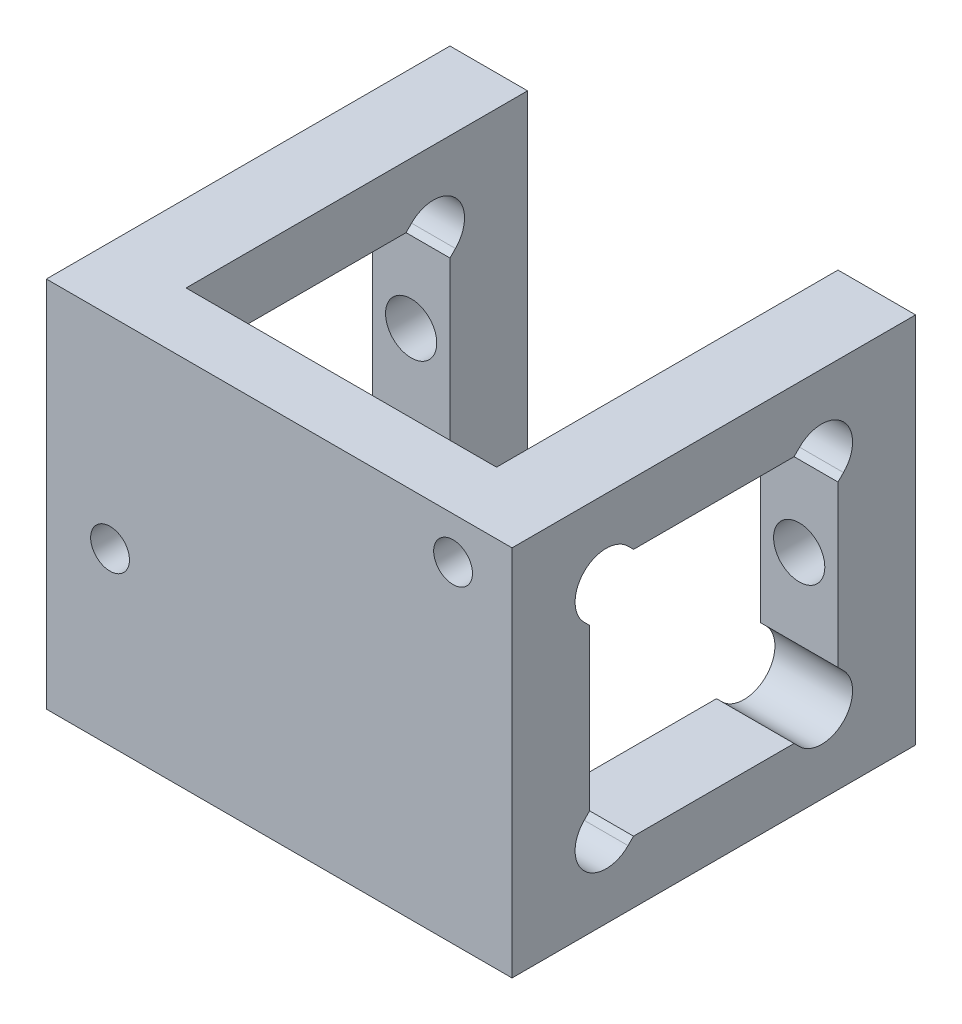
from build123d import *

# Parameters (mm, degrees)
BOSS_EXTRU_1_START      = 9
ESQUISSE1_W             = 30
ESQUISSE1_H             = 24
BOSS_EXTRU_1_DEPTH      = 4
ESQUISSE4_W             = 26
ESQUISSE4_H             = 24
ESQUISSE4_W_2           = 16
ESQUISSE4_H_2           = 16
BOSS_EXTRU_3_DEPTH      = 5
ENL_V_MAT_EXTRU_3_DEPTH = 10
BOSS_EXTRU_4_START      = -5
ESQUISSE11_W            = 22
ESQUISSE11_H            = 24
BOSS_EXTRU_4_DEPTH      = 5
TROU_TARAUD_M42_D       = 3.3
TROU_TARAUD_M42_DEPTH   = 11.5
TROU_TARAUD_M42_TIP     = 0.991420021
TROU_TARAUD_M31_D       = 2.5
TROU_TARAUD_M31_DEPTH   = 8.5
TROU_TARAUD_M31_TIP     = 0.751075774


with BuildPart() as part:
    # Esquisse1 → Boss.-Extru.1 (new body)
    with BuildSketch(Plane.XY.offset(BOSS_EXTRU_1_START)):
        with Locations((15, -12)):
            Rectangle(ESQUISSE1_W, ESQUISSE1_H)
    extrude(amount=BOSS_EXTRU_1_DEPTH)

    # Esquisse4 → Boss.-Extru.3 (add)
    with BuildSketch(Plane.ZY):
        with Locations((0, -12)):
            Rectangle(ESQUISSE4_W, ESQUISSE4_H)
        with Locations((0, -12)):
            Rectangle(ESQUISSE4_W_2, ESQUISSE4_H_2, mode=Mode.SUBTRACT)
    extrude(amount=-BOSS_EXTRU_3_DEPTH)

    # Esquisse10 → Enl_v. mat.-Extru.3 (cut)
    with BuildSketch(Plane.ZY):
        with BuildLine():
            Line((-5.525126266, -3.646446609), (-3.423589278, -5.747983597))
            Line((-3.423589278, -5.747983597), (-6.574535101, -8.253892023))
            Line((-6.574535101, -8.253892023), (-8.353553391, -6.474873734))
            ThreePointArc((-8.353553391, -6.474873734), (-8.353553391, -3.646446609), (-5.525126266, -3.646446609))
        make_face()
        with BuildLine():
            Line((8.352553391, -6.473873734), (6.251016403, -8.575410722))
            Line((6.251016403, -8.575410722), (3.745107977, -5.424464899))
            Line((3.745107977, -5.424464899), (5.524126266, -3.645446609))
            ThreePointArc((5.524126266, -3.645446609), (8.352553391, -3.645446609), (8.352553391, -6.473873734))
        make_face()
        with BuildLine():
            Line((5.525126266, -20.351553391), (3.423589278, -18.250016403))
            Line((3.423589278, -18.250016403), (6.574535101, -15.744107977))
            Line((6.574535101, -15.744107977), (8.353553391, -17.523126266))
            ThreePointArc((8.353553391, -17.523126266), (8.353553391, -20.351553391), (5.525126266, -20.351553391))
        make_face()
        with BuildLine():
            Line((-8.352553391, -17.524126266), (-6.251016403, -15.422589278))
            Line((-6.251016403, -15.422589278), (-3.745107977, -18.573535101))
            Line((-3.745107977, -18.573535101), (-5.524126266, -20.352553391))
            ThreePointArc((-5.524126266, -20.352553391), (-8.352553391, -20.352553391), (-8.352553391, -17.524126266))
        make_face()
    extrude(amount=-ENL_V_MAT_EXTRU_3_DEPTH, mode=Mode.SUBTRACT)

    # Esquisse11 → Boss.-Extru.4 (add)
    with BuildSketch(Plane(origin=(30, 0, 0), x_dir=(0, 0, -1), z_dir=(1, 0, 0)).offset(BOSS_EXTRU_4_START)):
        with Locations((2, -12)):
            Rectangle(ESQUISSE11_W, ESQUISSE11_H)
        with BuildLine():
            Line((5.525126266, -3.646446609), (5.171572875, -4))
            Line((5.171572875, -4), (-5.169572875, -4))
            Line((-5.169572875, -4), (-5.524126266, -3.645446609))
            ThreePointArc((-5.524126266, -3.645446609), (-8.352553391, -3.645446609), (-8.352553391, -6.473873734))
            Line((-8.352553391, -6.473873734), (-8, -6.826427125))
            Line((-8, -6.826427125), (-8, -17.169572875))
            Line((-8, -17.169572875), (-8.353553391, -17.523126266))
            ThreePointArc((-8.353553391, -17.523126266), (-8.353553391, -20.351553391), (-5.525126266, -20.351553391))
            Line((-5.525126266, -20.351553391), (-5.173572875, -20))
            Line((-5.173572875, -20), (5.171572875, -20))
            Line((5.171572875, -20), (5.524126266, -20.352553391))
            ThreePointArc((5.524126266, -20.352553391), (8.352553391, -20.352553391), (8.352553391, -17.524126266))
            Line((8.352553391, -17.524126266), (8, -17.171572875))
            Line((8, -17.171572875), (8, -6.828427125))
            Line((8, -6.828427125), (8.353553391, -6.474873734))
            ThreePointArc((8.353553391, -6.474873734), (8.353553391, -3.646446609), (5.525126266, -3.646446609))
        make_face(mode=Mode.SUBTRACT)
    extrude(amount=BOSS_EXTRU_4_DEPTH)

    # Trou taraud_ M42
    with Locations(Plane(origin=(0, 0, -13), x_dir=(-1, 0, 0), z_dir=(0, 0, -1))):
        with Locations((-27.5, -12), (-2.5, -12)):
            Hole(TROU_TARAUD_M42_D / 2, depth=TROU_TARAUD_M42_DEPTH)
            with Locations((0, 0, -(TROU_TARAUD_M42_DEPTH + TROU_TARAUD_M42_TIP / 2))):  # 118° drill point
                Cone(0, TROU_TARAUD_M42_D / 2, TROU_TARAUD_M42_TIP, mode=Mode.SUBTRACT)

    # Trou taraud_ M31
    with Locations(Plane.XY.offset(13)):
        with Locations((26.2, -2.7), (4.1, -13)):
            Hole(TROU_TARAUD_M31_D / 2, depth=TROU_TARAUD_M31_DEPTH)
            with Locations((0, 0, -(TROU_TARAUD_M31_DEPTH + TROU_TARAUD_M31_TIP / 2))):  # 118° drill point
                Cone(0, TROU_TARAUD_M31_D / 2, TROU_TARAUD_M31_TIP, mode=Mode.SUBTRACT)


solid = part.part
